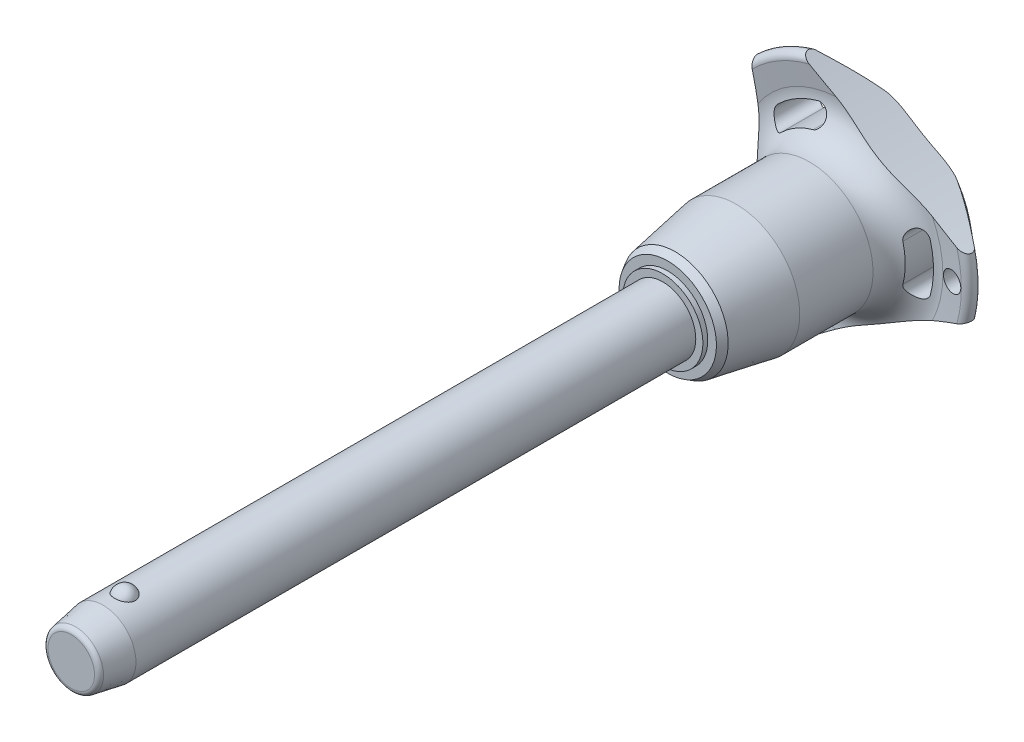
from build123d import *

# Parameters (mm, degrees)
SKETCH1_R           = 5
BOSS_EXTRUDE1_DEPTH = 80
SKETCH2_R           = 4.25
BOSS_EXTRUDE2_DEPTH = 33.3
BOSS_EXTRUDE3_START = 9.6
SKETCH1_2_R         = 5
BOSS_EXTRUDE3_DEPTH = 9.6
CHAMFER1_SIZE       = 4.8
CHAMFER1_SIZE2      = 0.846369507
FILLET1_R           = 0.75
SKETCH6_R           = 102.8
CUT_EXTRUDE1_DEPTH  = 117.644873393
CIRPATTERN1_COUNT   = 3
SKETCH7_R           = 1.5
CUT_EXTRUDE2_DEPTH  = 117.506132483


with BuildPart() as part:
    # Sketch1 → Boss-Extrude1 (new body)
    with BuildSketch(Plane.XY):
        Circle(SKETCH1_R)
    extrude(amount=-BOSS_EXTRUDE1_DEPTH)

    # Sketch2 → Boss-Extrude2 (add)
    with BuildSketch(Plane(origin=(0, 0, -80), x_dir=(-1, 0, 0), z_dir=(0, 0, -1))):
        Circle(SKETCH2_R)
    extrude(amount=BOSS_EXTRUDE2_DEPTH)

    # Sketch3 → Revolve1 (revolve)
    with BuildSketch(Plane(origin=(0, 0, 0), x_dir=(0, 0, -1), z_dir=(1, 0, 0))):
        with BuildLine():
            Line((-1.516575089, 6), (-1.516575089, 2.7))
            ThreePointArc((-1.516575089, 2.7), (0.133424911, 4.35), (-1.516575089, 6))
        make_face()
        with BuildLine():
            Line((-1.516575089, -2.7), (-1.516575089, -6))
            ThreePointArc((-1.516575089, -6), (0.133424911, -4.35), (-1.516575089, -2.7))
        make_face()
    revolve(axis=Axis((0, -2.7, 1.516575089), (0, 1, 0)))

    # Sketch1_2 → Boss-Extrude3 (add)
    with BuildSketch(Plane.XY.offset(BOSS_EXTRUDE3_START)):
        Circle(SKETCH1_2_R)
    extrude(amount=-BOSS_EXTRUDE3_DEPTH)

    # Chamfer1
    chamfer1_edges = [part.edges().sort_by_distance(p)[0] for p in [
        (-5, 0, 9.6),
    ]]
    chamfer1_side = [part.faces().sort_by_distance(p)[0] for p in [
        (-5, 0, -35.2),
    ]]
    chamfer(chamfer1_edges, length=CHAMFER1_SIZE, length2=CHAMFER1_SIZE2, reference=chamfer1_side[0])

    # Fillet1
    fillet1_edges = [part.edges().sort_by_distance(p)[0] for p in [
        (-4.153630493, 0, 9.6),
        (4.25, 0, -113.3),
    ]]
    fillet(fillet1_edges, radius=FILLET1_R)

    # Sketch4 → Revolve2 (revolve)
    with BuildSketch(Plane(origin=(0, 0, 0), x_dir=(0, 0, -1), z_dir=(1, 0, 0)), mode=Mode.PRIVATE) as revolve2_sk:
        Polygon((80, 0), (80, 6.067402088), (80.75, 6.067402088), (80.75, 7.371950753), (81.879772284, 8.024225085), (91.1, 9.65), (102.2, 9.65), (102.2, 0), align=None)
    revolve(revolve2_sk.sketch.rotate(Axis((0, 0, -102.2), (0, 0, 1)), 90), axis=Axis((0, 0, -102.2), (0, 0, 1)))

    # Sketch5 → Revolve3 (revolve)
    with BuildSketch(Plane(origin=(0, 0, 0), x_dir=(0, 0, -1), z_dir=(1, 0, 0)), mode=Mode.PRIVATE) as revolve3_sk:
        with BuildLine():
            Line((107.16082631, 15.274661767), (106.757834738, 18.475067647))
            ThreePointArc((106.757834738, 18.475067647), (107.349836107, 19.516443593), (108.516044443, 19.24278761))
            Line((108.516044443, 19.24278761), (112.835691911, 14.094832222))
            ThreePointArc((112.835691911, 14.094832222), (113.3, 12.689260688), (112.67067517, 11.349423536))
            ThreePointArc((112.67067517, 11.349423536), (109.033110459, 6.185112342), (107.75, 0))
            Line((107.75, 0), (102.2, 0))
            Line((102.2, 0), (102.2, 9.65))
            ThreePointArc((102.2, 9.65), (105.949887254, 11.342683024), (107.16082631, 15.274661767))
        make_face()
    revolve(revolve3_sk.sketch.rotate(Axis((0, 0, -107.75), (0, 0, 1)), 90), axis=Axis((0, 0, -107.75), (0, 0, 1)))

    # Sketch6 → Cut-Extrude1 (cut, through all)
    with BuildSketch(Plane.XY):
        with Locations((-115.2, 0)):
            Circle(SKETCH6_R)
        with BuildLine():
            ThreePointArc((13.411913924, -3.529271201), (13.868496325, 0), (13.411913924, 3.529271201))
            ThreePointArc((13.411913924, 3.529271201), (11.694200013, 4.531299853), (10.692171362, 2.813585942))
            ThreePointArc((10.692171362, 2.813585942), (11.056165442, 0), (10.692171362, -2.813585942))
            ThreePointArc((10.692171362, -2.813585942), (11.694200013, -4.531299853), (13.411913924, -3.529271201))
        make_face()
    cut_extrude1 = extrude(amount=-CUT_EXTRUDE1_DEPTH, mode=Mode.SUBTRACT)

    # CirPattern1: Cut-Extrude1 ×3 about axis
    cirpattern1_axis = Axis((0, 0, 0), (0, 0, 1))
    for i in range(1, CIRPATTERN1_COUNT):
        add(cut_extrude1.rotate(cirpattern1_axis, i * 360 / CIRPATTERN1_COUNT), mode=Mode.SUBTRACT)

    # Sketch7 → Cut-Extrude2 (cut, through all)
    with BuildSketch(Plane.XY):
        with Locations(Location((16.868496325, 0, 0), (0, 0, 225.467095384))):
            Circle(SKETCH7_R)
    extrude(amount=-CUT_EXTRUDE2_DEPTH, mode=Mode.SUBTRACT)


solid = part.part
